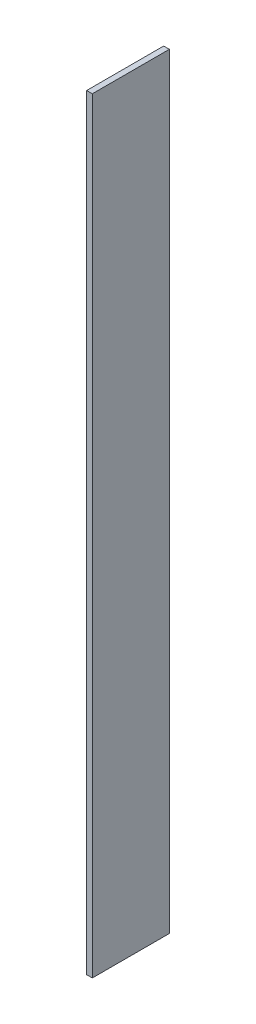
ISO-10303-21;
HEADER;
FILE_DESCRIPTION(('STEP AP214'),'2;1');
FILE_NAME('part.step','',(''),(''),'','','');
FILE_SCHEMA(('AUTOMOTIVE_DESIGN { 1 0 10303 214 1 1 1 1 }'));
ENDSEC;
DATA;
#1=APPLICATION_CONTEXT('core data for automotive mechanical design processes');
#2=APPLICATION_PROTOCOL_DEFINITION('international standard','automotive_design',2000,#1);
#3=PRODUCT_CONTEXT('',#1,'mechanical');
#4=PRODUCT('Part','Part','',(#3));
#5=PRODUCT_RELATED_PRODUCT_CATEGORY('part','',(#4));
#6=PRODUCT_DEFINITION_FORMATION('','',#4);
#7=PRODUCT_DEFINITION_CONTEXT('part definition',#1,'design');
#8=PRODUCT_DEFINITION('design','',#6,#7);
#9=PRODUCT_DEFINITION_SHAPE('','',#8);
#10=(LENGTH_UNIT() NAMED_UNIT(*) SI_UNIT(.MILLI.,.METRE.));
#11=(NAMED_UNIT(*) PLANE_ANGLE_UNIT() SI_UNIT($,.RADIAN.));
#12=(NAMED_UNIT(*) SI_UNIT($,.STERADIAN.) SOLID_ANGLE_UNIT());
#13=UNCERTAINTY_MEASURE_WITH_UNIT(LENGTH_MEASURE(1.E-05),#10,'distance_accuracy_value','');
#14=(GEOMETRIC_REPRESENTATION_CONTEXT(3) GLOBAL_UNCERTAINTY_ASSIGNED_CONTEXT((#13)) GLOBAL_UNIT_ASSIGNED_CONTEXT((#10,
#11,#12)) REPRESENTATION_CONTEXT('',''));
#15=CARTESIAN_POINT('',(0.,0.,0.));
#16=DIRECTION('',(0.,0.,1.));
#17=DIRECTION('',(1.,0.,0.));
#18=AXIS2_PLACEMENT_3D('',#15,#16,#17);
#19=CARTESIAN_POINT('',(2.,1.01648305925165,10.));
#20=DIRECTION('',(0.,0.,1.));
#21=DIRECTION('',(0.,-1.,0.));
#22=AXIS2_PLACEMENT_3D('',#19,#20,#21);
#23=PLANE('',#22);
#24=DIRECTION('',(0.,-1.,0.));
#25=VECTOR('',#24,1.);
#26=CARTESIAN_POINT('',(0.,0.279883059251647,10.));
#27=LINE('',#26,#25);
#28=CARTESIAN_POINT('',(0.,50.8785714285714,10.));
#29=VERTEX_POINT('',#28);
#30=CARTESIAN_POINT('',(0.,-48.4685566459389,10.));
#31=VERTEX_POINT('',#30);
#32=EDGE_CURVE('E98',#29,#31,#27,.T.);
#33=ORIENTED_EDGE('',*,*,#32,.F.);
#34=DIRECTION('',(1.,0.,0.));
#35=VECTOR('',#34,1.);
#36=CARTESIAN_POINT('',(-0.7366,50.8785714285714,10.));
#37=LINE('',#36,#35);
#38=CARTESIAN_POINT('',(-0.7366,50.8785714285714,10.));
#39=VERTEX_POINT('',#38);
#40=EDGE_CURVE('E94',#39,#29,#37,.T.);
#41=ORIENTED_EDGE('',*,*,#40,.F.);
#42=DIRECTION('',(0.,-1.,0.));
#43=VECTOR('',#42,1.);
#44=CARTESIAN_POINT('',(-0.7366,0.279883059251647,10.));
#45=LINE('',#44,#43);
#46=CARTESIAN_POINT('',(-0.736599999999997,-48.4685566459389,10.));
#47=VERTEX_POINT('',#46);
#48=EDGE_CURVE('E80',#39,#47,#45,.T.);
#49=ORIENTED_EDGE('',*,*,#48,.T.);
#50=DIRECTION('',(-1.,0.,0.));
#51=VECTOR('',#50,1.);
#52=CARTESIAN_POINT('',(0.,-48.4685566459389,10.));
#53=LINE('',#52,#51);
#54=EDGE_CURVE('E87',#31,#47,#53,.T.);
#55=ORIENTED_EDGE('',*,*,#54,.F.);
#56=EDGE_LOOP('',(#33,#41,#49,#55));
#57=FACE_BOUND('',#56,.T.);
#58=ADVANCED_FACE('F39',(#57),#23,.T.);
#59=CARTESIAN_POINT('',(-0.7366,0.279883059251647,10.));
#60=DIRECTION('',(1.,0.,0.));
#61=DIRECTION('',(0.,0.,1.));
#62=AXIS2_PLACEMENT_3D('',#59,#60,#61);
#63=PLANE('',#62);
#64=DIRECTION('',(0.,-1.,0.));
#65=VECTOR('',#64,1.);
#66=CARTESIAN_POINT('',(-0.7366,0.279883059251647,0.));
#67=LINE('',#66,#65);
#68=CARTESIAN_POINT('',(-0.7366,50.8785714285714,0.));
#69=VERTEX_POINT('',#68);
#70=CARTESIAN_POINT('',(-0.736599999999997,-48.4685566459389,0.));
#71=VERTEX_POINT('',#70);
#72=EDGE_CURVE('E70',#69,#71,#67,.T.);
#73=ORIENTED_EDGE('',*,*,#72,.T.);
#74=DIRECTION('',(0.,0.,-1.));
#75=VECTOR('',#74,1.);
#76=CARTESIAN_POINT('',(-0.736599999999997,-48.4685566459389,10.));
#77=LINE('',#76,#75);
#78=EDGE_CURVE('E12',#47,#71,#77,.T.);
#79=ORIENTED_EDGE('',*,*,#78,.F.);
#80=ORIENTED_EDGE('',*,*,#48,.F.);
#81=DIRECTION('',(0.,0.,-1.));
#82=VECTOR('',#81,1.);
#83=CARTESIAN_POINT('',(-0.7366,50.8785714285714,10.));
#84=LINE('',#83,#82);
#85=EDGE_CURVE('E83',#39,#69,#84,.T.);
#86=ORIENTED_EDGE('',*,*,#85,.T.);
#87=EDGE_LOOP('',(#73,#79,#80,#86));
#88=FACE_BOUND('',#87,.T.);
#89=ADVANCED_FACE('F82',(#88),#63,.F.);
#90=CARTESIAN_POINT('',(0.,-48.4685566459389,10.));
#91=DIRECTION('',(0.,-1.,0.));
#92=DIRECTION('',(0.,0.,-1.));
#93=AXIS2_PLACEMENT_3D('',#90,#91,#92);
#94=PLANE('',#93);
#95=DIRECTION('',(-1.,0.,0.));
#96=VECTOR('',#95,1.);
#97=CARTESIAN_POINT('',(0.,-48.4685566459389,0.));
#98=LINE('',#97,#96);
#99=CARTESIAN_POINT('',(0.,-48.4685566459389,0.));
#100=VERTEX_POINT('',#99);
#101=EDGE_CURVE('E108',#100,#71,#98,.T.);
#102=ORIENTED_EDGE('',*,*,#101,.F.);
#103=DIRECTION('',(0.,0.,-1.));
#104=VECTOR('',#103,1.);
#105=CARTESIAN_POINT('',(0.,-48.4685566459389,10.));
#106=LINE('',#105,#104);
#107=EDGE_CURVE('E48',#31,#100,#106,.T.);
#108=ORIENTED_EDGE('',*,*,#107,.F.);
#109=ORIENTED_EDGE('',*,*,#54,.T.);
#110=ORIENTED_EDGE('',*,*,#78,.T.);
#111=EDGE_LOOP('',(#102,#108,#109,#110));
#112=FACE_BOUND('',#111,.T.);
#113=ADVANCED_FACE('F112',(#112),#94,.T.);
#114=CARTESIAN_POINT('',(0.,50.8785714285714,10.));
#115=DIRECTION('',(1.,0.,0.));
#116=DIRECTION('',(0.,0.,-1.));
#117=AXIS2_PLACEMENT_3D('',#114,#115,#116);
#118=PLANE('',#117);
#119=DIRECTION('',(0.,-1.,0.));
#120=VECTOR('',#119,1.);
#121=CARTESIAN_POINT('',(0.,0.279883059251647,0.));
#122=LINE('',#121,#120);
#123=CARTESIAN_POINT('',(0.,50.8785714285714,0.));
#124=VERTEX_POINT('',#123);
#125=EDGE_CURVE('E88',#124,#100,#122,.T.);
#126=ORIENTED_EDGE('',*,*,#125,.F.);
#127=DIRECTION('',(0.,0.,-1.));
#128=VECTOR('',#127,1.);
#129=CARTESIAN_POINT('',(0.,50.8785714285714,10.));
#130=LINE('',#129,#128);
#131=EDGE_CURVE('E100',#29,#124,#130,.T.);
#132=ORIENTED_EDGE('',*,*,#131,.F.);
#133=ORIENTED_EDGE('',*,*,#32,.T.);
#134=ORIENTED_EDGE('',*,*,#107,.T.);
#135=EDGE_LOOP('',(#126,#132,#133,#134));
#136=FACE_BOUND('',#135,.T.);
#137=ADVANCED_FACE('F41',(#136),#118,.T.);
#138=CARTESIAN_POINT('',(2.,-1.72011694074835,0.));
#139=DIRECTION('',(0.,0.,-1.));
#140=DIRECTION('',(0.,1.,0.));
#141=AXIS2_PLACEMENT_3D('',#138,#139,#140);
#142=PLANE('',#141);
#143=ORIENTED_EDGE('',*,*,#72,.F.);
#144=DIRECTION('',(1.,0.,0.));
#145=VECTOR('',#144,1.);
#146=CARTESIAN_POINT('',(-0.7366,50.8785714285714,0.));
#147=LINE('',#146,#145);
#148=EDGE_CURVE('E95',#69,#124,#147,.T.);
#149=ORIENTED_EDGE('',*,*,#148,.T.);
#150=ORIENTED_EDGE('',*,*,#125,.T.);
#151=ORIENTED_EDGE('',*,*,#101,.T.);
#152=EDGE_LOOP('',(#143,#149,#150,#151));
#153=FACE_BOUND('',#152,.T.);
#154=ADVANCED_FACE('F113',(#153),#142,.T.);
#155=CARTESIAN_POINT('',(-0.7366,50.8785714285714,10.));
#156=DIRECTION('',(0.,1.,0.));
#157=DIRECTION('',(0.,0.,1.));
#158=AXIS2_PLACEMENT_3D('',#155,#156,#157);
#159=PLANE('',#158);
#160=ORIENTED_EDGE('',*,*,#148,.F.);
#161=ORIENTED_EDGE('',*,*,#85,.F.);
#162=ORIENTED_EDGE('',*,*,#40,.T.);
#163=ORIENTED_EDGE('',*,*,#131,.T.);
#164=EDGE_LOOP('',(#160,#161,#162,#163));
#165=FACE_BOUND('',#164,.T.);
#166=ADVANCED_FACE('F92',(#165),#159,.T.);
#167=CLOSED_SHELL('',(#58,#89,#113,#137,#154,#166));
#168=MANIFOLD_SOLID_BREP('B2',#167);
#169=ADVANCED_BREP_SHAPE_REPRESENTATION('',(#18,#168),#14);
#170=SHAPE_DEFINITION_REPRESENTATION(#9,#169);
ENDSEC;
END-ISO-10303-21;
